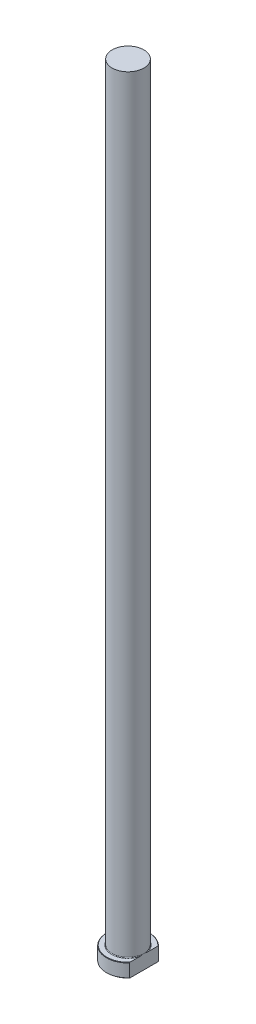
from build123d import *
from build123d.topology import SkipClean

# Parameters (mm, degrees)
CHAMFER1_SIZE = 0.2
FILLET1_R     = 0.3
KEY_DEPTH     = 401.302385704


with BuildPart() as part:
    # Sketch1 → Revolve1 (revolve)
    with BuildSketch(Plane.XY, mode=Mode.PRIVATE) as revolve1_sk:
        Polygon((0, 0), (-11, 0), (-11, 7), (-8.1, 7), (-8.1, 400), (0, 400), align=None)
    revolve(revolve1_sk.sketch.rotate(Axis((0, 259.958771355, 0), (0, -1, 0)), 270), axis=Axis((0, 259.958771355, 0), (0, -1, 0)))

    # Chamfer1
    chamfer1_edges = [part.edges().sort_by_distance(p)[0] for p in [
        (0, 7, -11),
        (0, 0, -11),
    ]]
    chamfer(chamfer1_edges, length=CHAMFER1_SIZE)

    # Fillet1
    fillet1_edges = [part.edges().sort_by_distance(p)[0] for p in [
        (0, 7, -8.1),
    ]]
    fillet(fillet1_edges, radius=FILLET1_R)

    # Sketch2 → KEY (cut, through all)
    with SkipClean():  # the faces are left unmerged after this step: merging them gives an invalid solid
        with BuildSketch(Plane(origin=(0, 0, 0), x_dir=(1, 0, 0), z_dir=(0, 1, 0))):
            with BuildLine():
                Line((8.1, 7.442445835), (8.1, -7.442445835))
                ThreePointArc((8.1, -7.442445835), (11, 0), (8.1, 7.442445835))
            make_face()
        extrude(amount=KEY_DEPTH, mode=Mode.SUBTRACT)


solid = part.part
